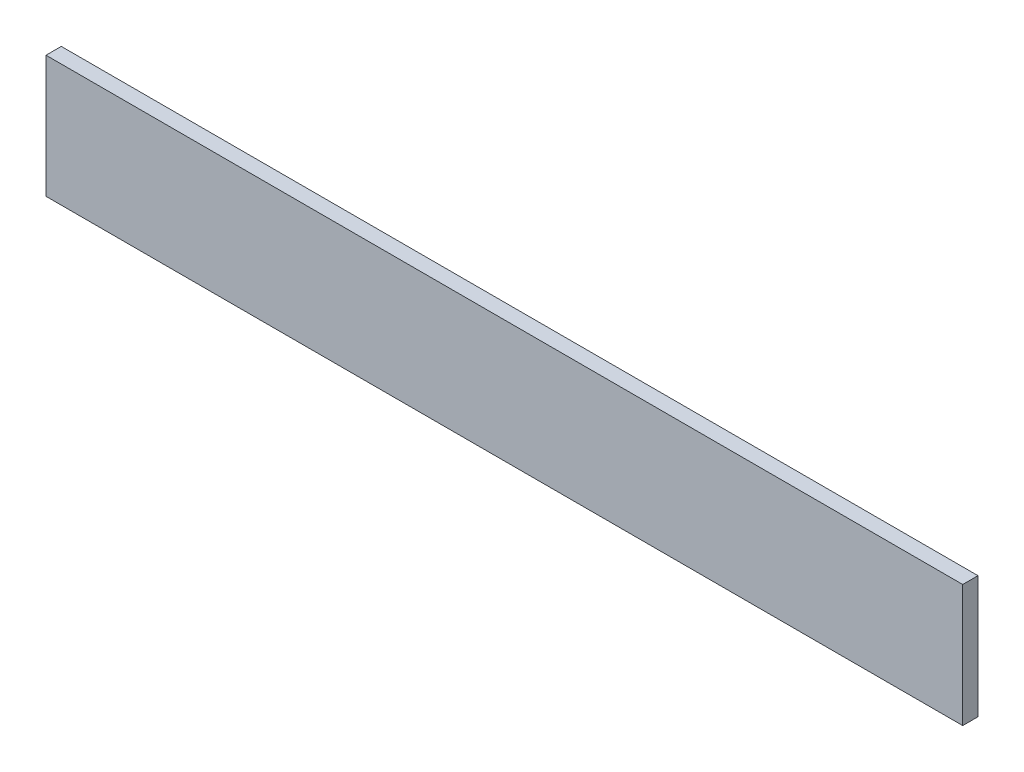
from build123d import *

# Parameters (mm, degrees)
SKETCH1_W      = 762
SKETCH1_H      = 101.6
EXTRUDE1_DEPTH = 12.7


with BuildPart() as part:
    # Sketch1 → Extrude1 (new body)
    with BuildSketch(Plane.XY):
        with Locations((199.569871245, 20.221888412)):
            Rectangle(SKETCH1_W, SKETCH1_H)
    extrude(amount=EXTRUDE1_DEPTH)


solid = part.part
